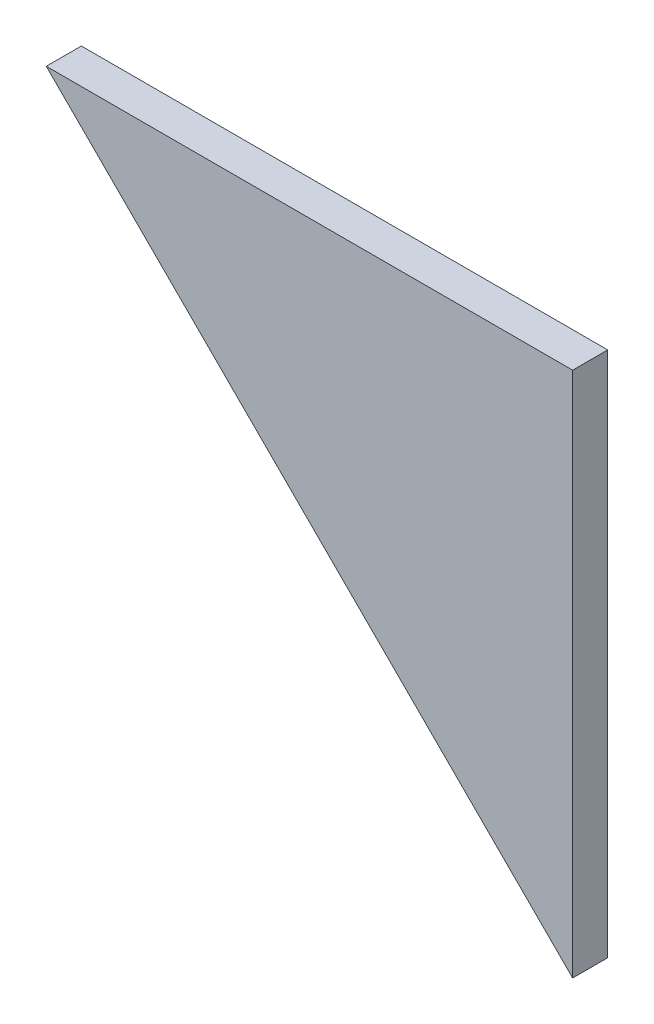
from build123d import *

# Parameters (mm, degrees)
BOSS_EXTRU_1_DEPTH = 10


with BuildPart() as part:
    # Esquisse1 → Boss.-Extru.1 (new body)
    with BuildSketch(Plane.XY):
        Polygon((0, 0), (150, 0), (150, -150), align=None)
    extrude(amount=BOSS_EXTRU_1_DEPTH)


solid = part.part
